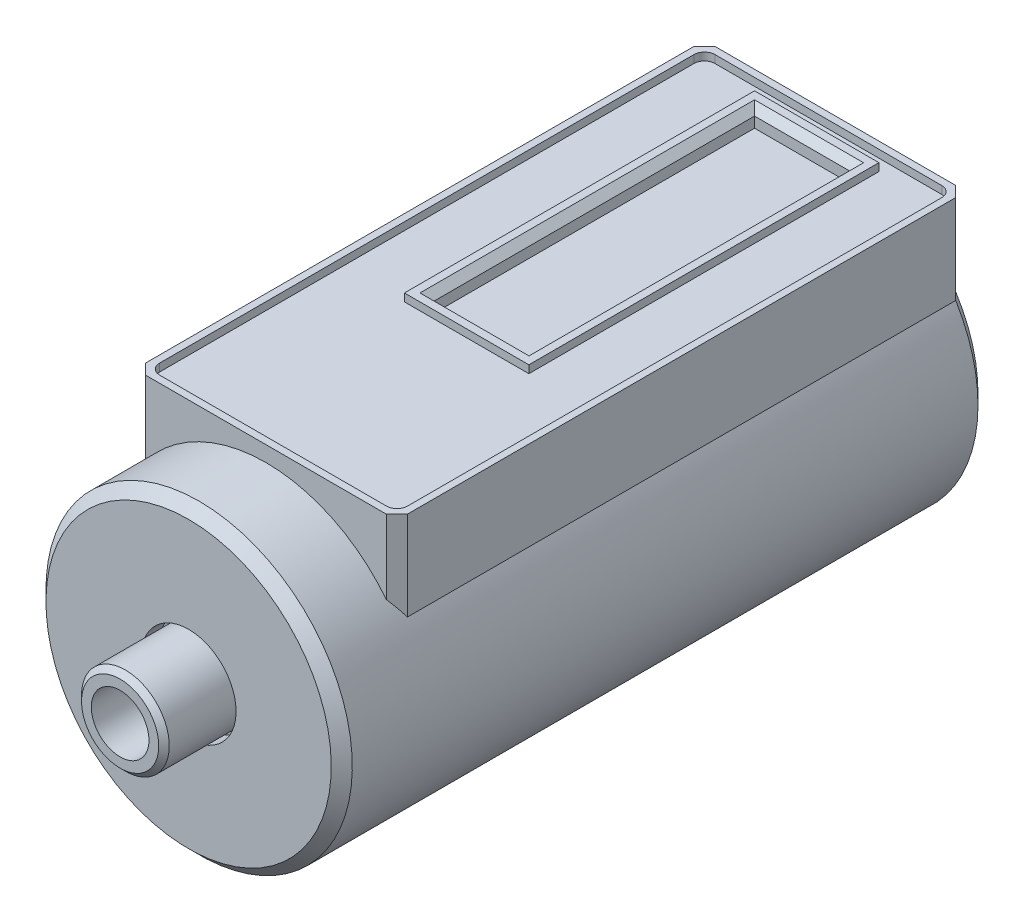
from build123d import *

# Parameters (mm, degrees)
EXTRUDE1_DEPTH     = 12.19
CHAMFER1_SIZE      = 0.76
SKETCH4_W          = 8.99
SKETCH4_H          = 25.3
CUT_EXTRUDE1_DEPTH = 0.56
SKETCH5_W          = 6.86
SKETCH5_H          = 23.16
CUT_EXTRUDE2_DEPTH = 1.27
CHAMFER2_SIZE      = 0.51
HOLE1_D            = 4.1656
HOLE1_DEPTH        = 6.35
HOLE1_TIP          = 1.251472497


with BuildPart() as part:
    # Sketch2 → Revolve1 (revolve)
    with BuildSketch(Plane(origin=(0, 0, 0), x_dir=(0, 0, -1), z_dir=(1, 0, 0))):
        Polygon((4.31, 0), (4.31, 2.79), (4.69, 3.17), (10.53, 3.17), (10.53, 3.43), (9.26, 3.43), (9.26, 10.31), (10.02, 11.07), (56, 11.07), (56, 0), align=None)
    revolve(axis=Axis((0, 0, -56), (0, 0, 1)))

    # Sketch3 → Extrude1 (add)
    with BuildSketch(Plane(origin=(0, 0, 0), x_dir=(1, 0, 0), z_dir=(0, 1, 0))):
        Polygon((-9.46, 56), (9.46, 56), (9.46, 15.61), (8.7, 14.85), (-8.7, 14.85), (-9.46, 15.61), align=None)
    extrude(amount=EXTRUDE1_DEPTH)

    # Chamfer1
    chamfer1_edges = [part.edges().sort_by_distance(p)[0] for p in [
        (0, -11.07, -56),
        (-9.46, 8.969599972, -56),
        (9.46, 8.969599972, -56),
    ]]
    chamfer(chamfer1_edges, length=CHAMFER1_SIZE)

    # Sketch4 → Cut-Extrude1 (cut)
    with BuildSketch(Plane(origin=(0, 12.19, 0), x_dir=(1, 0, 0), z_dir=(0, 1, 0))):
        with BuildLine():
            Line((-8.19, 55.49), (8.2, 55.49))
            ThreePointArc((8.2, 55.49), (8.737401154, 55.267401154), (8.96, 54.73))
            Line((8.96, 54.73), (8.96, 16.12))
            ThreePointArc((8.96, 16.12), (8.737401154, 15.582598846), (8.2, 15.36))
            Line((8.2, 15.36), (-8.19, 15.36))
            ThreePointArc((-8.19, 15.36), (-8.727401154, 15.582598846), (-8.95, 16.12))
            Line((-8.95, 16.12), (-8.95, 54.73))
            ThreePointArc((-8.95, 54.73), (-8.727401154, 55.267401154), (-8.19, 55.49))
        make_face()
        with Locations((0.005, 42)):
            Rectangle(SKETCH4_W, SKETCH4_H, mode=Mode.SUBTRACT)
    extrude(amount=-CUT_EXTRUDE1_DEPTH, mode=Mode.SUBTRACT)

    # Sketch5 → Cut-Extrude2 (cut)
    with BuildSketch(Plane(origin=(0, 12.19, 0), x_dir=(1, 0, 0), z_dir=(0, 1, 0))):
        with Locations((0.01, 42)):
            Rectangle(SKETCH5_W, SKETCH5_H)
    extrude(amount=-CUT_EXTRUDE2_DEPTH, mode=Mode.SUBTRACT)

    # Chamfer2
    chamfer2_edges = [part.edges().sort_by_distance(p)[0] for p in [
        (-3.42, 12.19, -42),
        (0.01, 12.19, -30.42),
        (3.44, 12.19, -42),
        (0.01, 12.19, -53.58),
    ]]
    chamfer(chamfer2_edges, length=CHAMFER2_SIZE)

    # Hole1
    with Locations(Plane.XY.offset(-4.31)):
        with Locations((0, 0)):
            Hole(HOLE1_D / 2, depth=HOLE1_DEPTH)
            with Locations((0, 0, -(HOLE1_DEPTH + HOLE1_TIP / 2))):  # 118° drill point
                Cone(0, HOLE1_D / 2, HOLE1_TIP, mode=Mode.SUBTRACT)


solid = part.part
